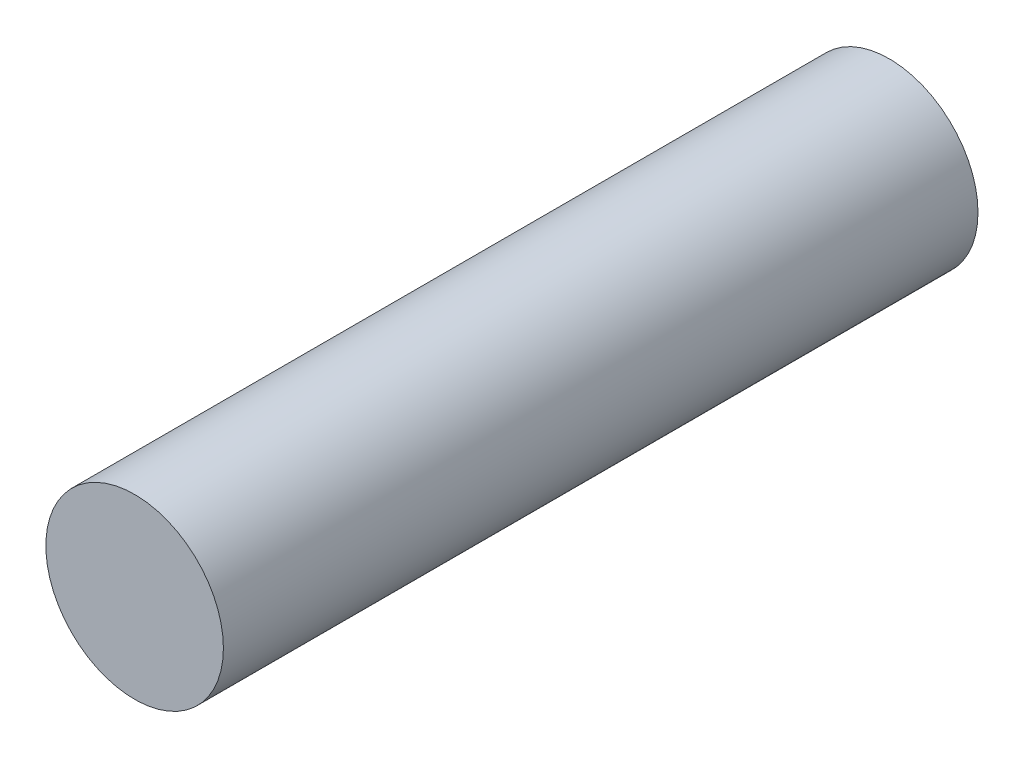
from build123d import *

# Parameters (mm, degrees)
ESQUISSE1_R          = 2
BASE_EXTRUSION_DEPTH = 17


with BuildPart() as part:
    # Esquisse1 → Base-Extrusion (new body)
    with BuildSketch(Plane.XY):
        Circle(ESQUISSE1_R)
    extrude(amount=-BASE_EXTRUSION_DEPTH)


solid = part.part
